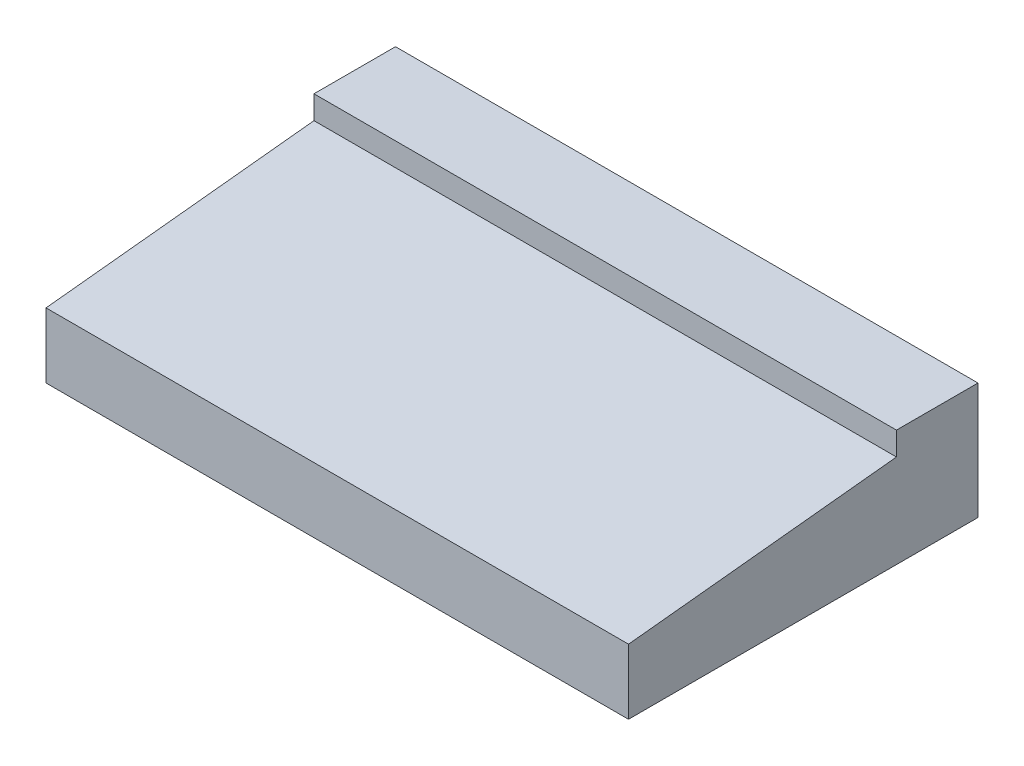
from build123d import *

# Parameters (mm, degrees)
EXTRUSION1_DEPTH = 50


with BuildPart() as part:
    # Esquisse1 → Extrusion1 (new body)
    with BuildSketch(Plane(origin=(0, 0, 0), x_dir=(0, 0, -1), z_dir=(1, 0, 0))):
        Polygon((0, 0), (0.002867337, 5.582903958), (23, 8), (23, 10), (30, 10), (30, 0), align=None)
    extrude(amount=EXTRUSION1_DEPTH)


solid = part.part
